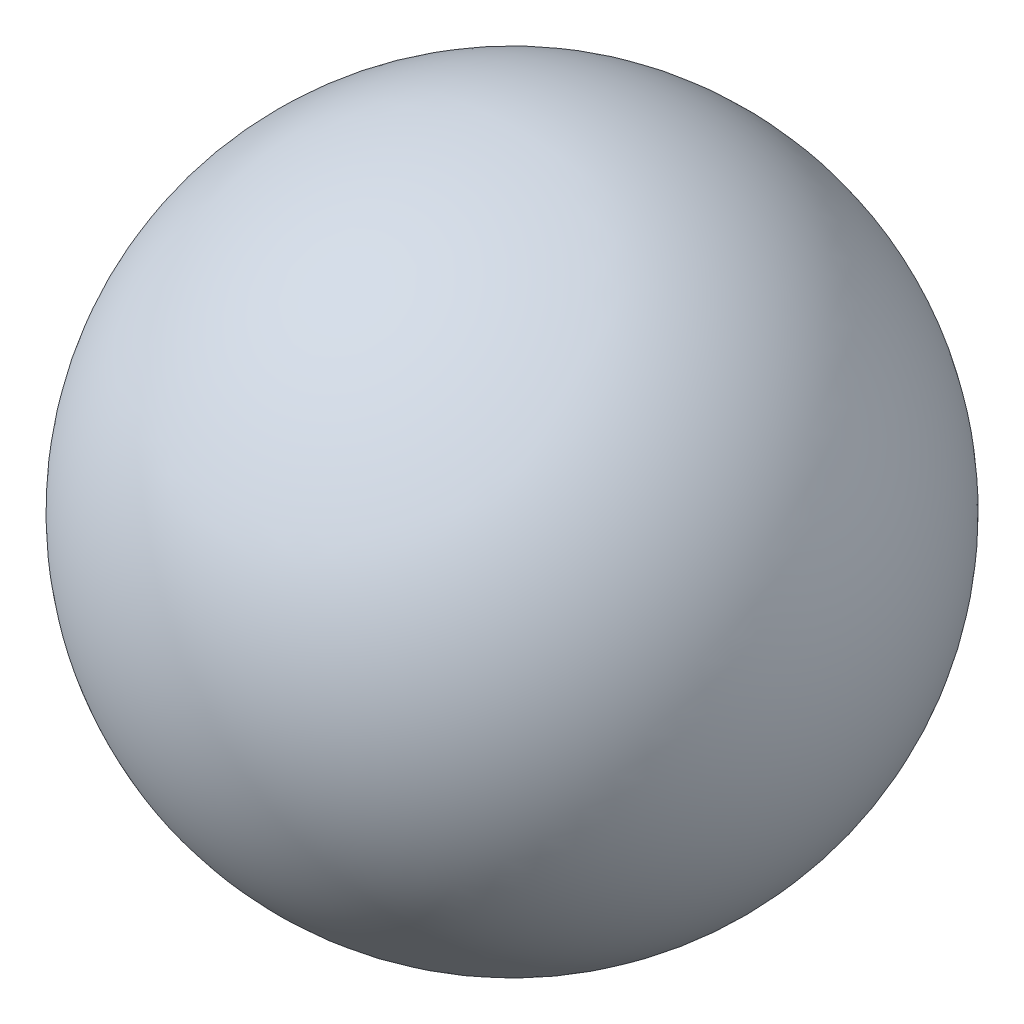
ISO-10303-21;
HEADER;
FILE_DESCRIPTION(('STEP AP214'),'2;1');
FILE_NAME('part.step','',(''),(''),'','','');
FILE_SCHEMA(('AUTOMOTIVE_DESIGN { 1 0 10303 214 1 1 1 1 }'));
ENDSEC;
DATA;
#1=APPLICATION_CONTEXT('core data for automotive mechanical design processes');
#2=APPLICATION_PROTOCOL_DEFINITION('international standard','automotive_design',2000,#1);
#3=PRODUCT_CONTEXT('',#1,'mechanical');
#4=PRODUCT('Part','Part','',(#3));
#5=PRODUCT_RELATED_PRODUCT_CATEGORY('part','',(#4));
#6=PRODUCT_DEFINITION_FORMATION('','',#4);
#7=PRODUCT_DEFINITION_CONTEXT('part definition',#1,'design');
#8=PRODUCT_DEFINITION('design','',#6,#7);
#9=PRODUCT_DEFINITION_SHAPE('','',#8);
#10=(LENGTH_UNIT() NAMED_UNIT(*) SI_UNIT(.MILLI.,.METRE.));
#11=(NAMED_UNIT(*) PLANE_ANGLE_UNIT() SI_UNIT($,.RADIAN.));
#12=(NAMED_UNIT(*) SI_UNIT($,.STERADIAN.) SOLID_ANGLE_UNIT());
#13=UNCERTAINTY_MEASURE_WITH_UNIT(LENGTH_MEASURE(1.E-05),#10,'distance_accuracy_value','');
#14=(GEOMETRIC_REPRESENTATION_CONTEXT(3) GLOBAL_UNCERTAINTY_ASSIGNED_CONTEXT((#13)) GLOBAL_UNIT_ASSIGNED_CONTEXT((#10,
#11,#12)) REPRESENTATION_CONTEXT('',''));
#15=CARTESIAN_POINT('',(0.,0.,0.));
#16=DIRECTION('',(0.,0.,1.));
#17=DIRECTION('',(1.,0.,0.));
#18=AXIS2_PLACEMENT_3D('',#15,#16,#17);
#19=CARTESIAN_POINT('',(0.,0.,13.));
#20=DIRECTION('',(0.,0.,1.));
#21=DIRECTION('',(-1.,0.,0.));
#22=AXIS2_PLACEMENT_3D('',#19,#20,#21);
#23=SPHERICAL_SURFACE('',#22,16.);
#24=CARTESIAN_POINT('',(-1.53436689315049E-07,0.,29.));
#25=VERTEX_POINT('',#24);
#26=VERTEX_LOOP('',#25);
#27=FACE_BOUND('',#26,.T.);
#28=CARTESIAN_POINT('',(0.,0.,0.));
#29=DIRECTION('',(0.,0.,1.));
#30=DIRECTION('',(0.,-1.,0.));
#31=AXIS2_PLACEMENT_3D('',#28,#29,#30);
#32=CIRCLE('',#31,9.32737905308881);
#33=CARTESIAN_POINT('',(0.,-9.32737905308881,0.));
#34=VERTEX_POINT('',#33);
#35=EDGE_CURVE('E30',#34,#34,#32,.T.);
#36=ORIENTED_EDGE('',*,*,#35,.T.);
#37=EDGE_LOOP('',(#36));
#38=FACE_BOUND('',#37,.T.);
#39=ADVANCED_FACE('F14',(#27,#38),#23,.T.);
#40=CARTESIAN_POINT('',(-9.439307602,9.47178797,0.));
#41=DIRECTION('',(0.,0.,1.));
#42=DIRECTION('',(0.,-1.,0.));
#43=AXIS2_PLACEMENT_3D('',#40,#41,#42);
#44=PLANE('',#43);
#45=CARTESIAN_POINT('',(0.,0.,0.));
#46=DIRECTION('',(0.,0.,1.));
#47=DIRECTION('',(0.,-1.,0.));
#48=AXIS2_PLACEMENT_3D('',#45,#46,#47);
#49=CIRCLE('',#48,4.);
#50=CARTESIAN_POINT('',(0.,-4.,0.));
#51=VERTEX_POINT('',#50);
#52=EDGE_CURVE('E21',#51,#51,#49,.T.);
#53=ORIENTED_EDGE('',*,*,#52,.T.);
#54=EDGE_LOOP('',(#53));
#55=FACE_BOUND('',#54,.T.);
#56=ORIENTED_EDGE('',*,*,#35,.F.);
#57=EDGE_LOOP('',(#56));
#58=FACE_BOUND('',#57,.T.);
#59=ADVANCED_FACE('F16',(#55,#58),#44,.F.);
#60=CARTESIAN_POINT('',(0.,0.,0.));
#61=DIRECTION('',(0.,0.,1.));
#62=DIRECTION('',(0.,-1.,0.));
#63=AXIS2_PLACEMENT_3D('',#60,#61,#62);
#64=CYLINDRICAL_SURFACE('',#63,4.);
#65=CARTESIAN_POINT('',(0.,0.,14.5));
#66=DIRECTION('',(0.,0.,-1.));
#67=DIRECTION('',(-1.,0.,0.));
#68=AXIS2_PLACEMENT_3D('',#65,#66,#67);
#69=CIRCLE('',#68,4.);
#70=CARTESIAN_POINT('',(-4.,0.,14.5));
#71=VERTEX_POINT('',#70);
#72=EDGE_CURVE('E9',#71,#71,#69,.T.);
#73=ORIENTED_EDGE('',*,*,#72,.F.);
#74=EDGE_LOOP('',(#73));
#75=FACE_BOUND('',#74,.T.);
#76=ORIENTED_EDGE('',*,*,#52,.F.);
#77=EDGE_LOOP('',(#76));
#78=FACE_BOUND('',#77,.T.);
#79=ADVANCED_FACE('F37',(#75,#78),#64,.F.);
#80=CARTESIAN_POINT('',(0.,0.,14.5));
#81=DIRECTION('',(0.,0.,-1.));
#82=DIRECTION('',(-1.,0.,0.));
#83=AXIS2_PLACEMENT_3D('',#80,#81,#82);
#84=PLANE('',#83);
#85=ORIENTED_EDGE('',*,*,#72,.T.);
#86=EDGE_LOOP('',(#85));
#87=FACE_BOUND('',#86,.T.);
#88=ADVANCED_FACE('F27',(#87),#84,.T.);
#89=CLOSED_SHELL('',(#39,#59,#79,#88));
#90=MANIFOLD_SOLID_BREP('B1',#89);
#91=ADVANCED_BREP_SHAPE_REPRESENTATION('',(#18,#90),#14);
#92=SHAPE_DEFINITION_REPRESENTATION(#9,#91);
ENDSEC;
END-ISO-10303-21;
